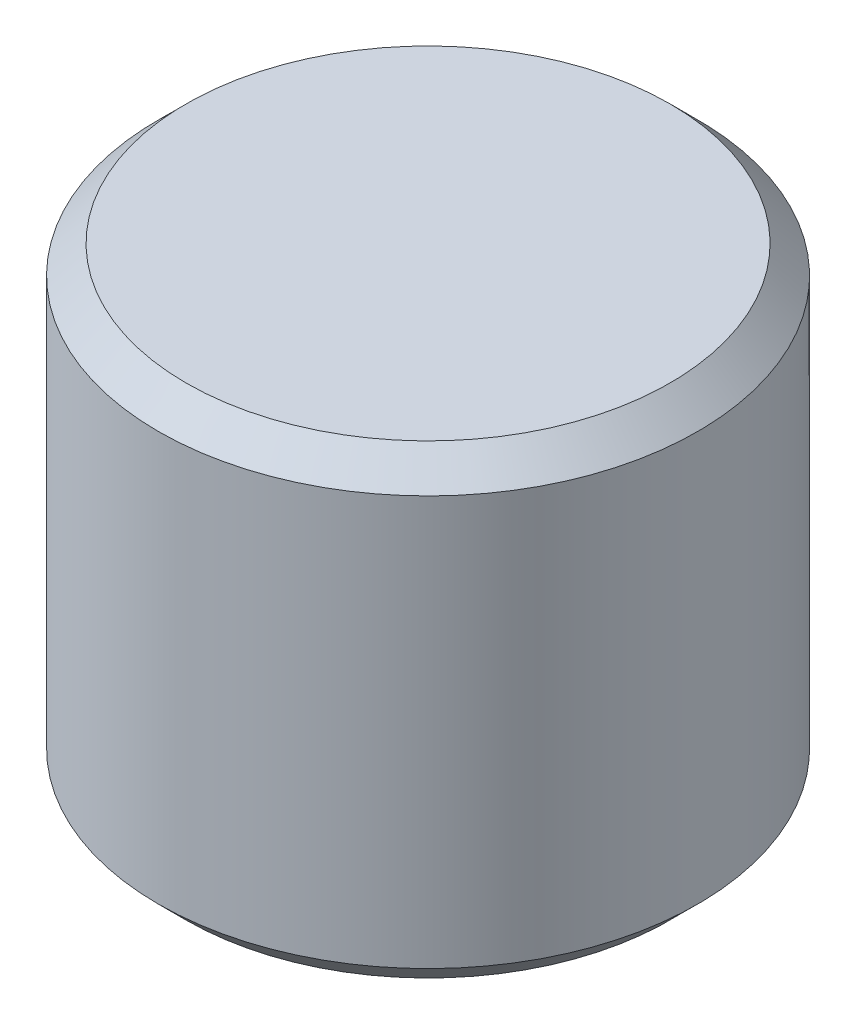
from build123d import *

# Parameters (mm, degrees)
SKETCH_1_R      = 14.5
EXTRUDE_1_DEPTH = 25
CHAMFER_1_SIZE  = 1.5


with BuildPart() as part:
    # Sketch 1 → Extrude 1 (new body)
    with BuildSketch(Plane(origin=(0, 0, 0), x_dir=(1, 0, 0), z_dir=(0, 1, 0))):
        with Locations(Location((0, 0, 0), (0, 0, 270))):
            Circle(SKETCH_1_R)
    extrude(amount=EXTRUDE_1_DEPTH)

    # Chamfer 1
    chamfer_1_edges = [part.edges().sort_by_distance(p)[0] for p in [
        (0, 0, -14.5),
        (0, 25, -14.5),
    ]]
    chamfer(chamfer_1_edges, length=CHAMFER_1_SIZE)


solid = part.part
